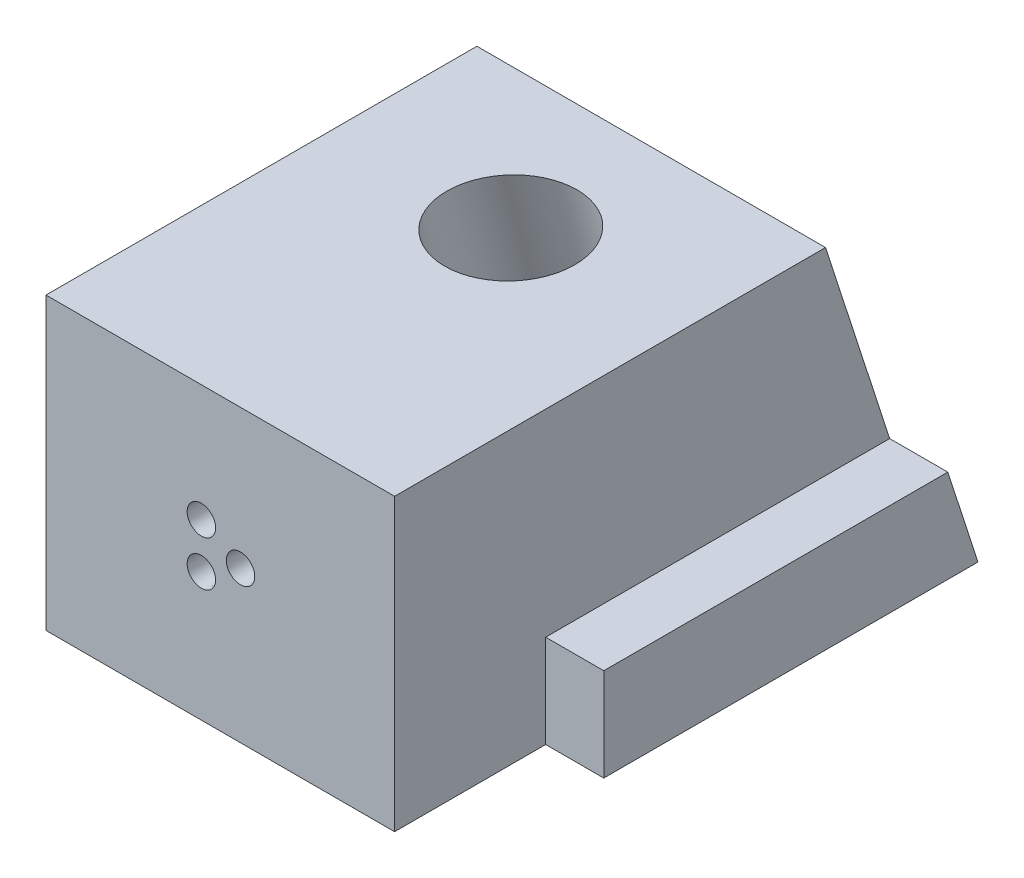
ISO-10303-21;
HEADER;
FILE_DESCRIPTION(('STEP AP214'),'2;1');
FILE_NAME('part.step','',(''),(''),'','','');
FILE_SCHEMA(('AUTOMOTIVE_DESIGN { 1 0 10303 214 1 1 1 1 }'));
ENDSEC;
DATA;
#1=APPLICATION_CONTEXT('core data for automotive mechanical design processes');
#2=APPLICATION_PROTOCOL_DEFINITION('international standard','automotive_design',2000,#1);
#3=PRODUCT_CONTEXT('',#1,'mechanical');
#4=PRODUCT('Part','Part','',(#3));
#5=PRODUCT_RELATED_PRODUCT_CATEGORY('part','',(#4));
#6=PRODUCT_DEFINITION_FORMATION('','',#4);
#7=PRODUCT_DEFINITION_CONTEXT('part definition',#1,'design');
#8=PRODUCT_DEFINITION('design','',#6,#7);
#9=PRODUCT_DEFINITION_SHAPE('','',#8);
#10=(LENGTH_UNIT() NAMED_UNIT(*) SI_UNIT(.MILLI.,.METRE.));
#11=(NAMED_UNIT(*) PLANE_ANGLE_UNIT() SI_UNIT($,.RADIAN.));
#12=(NAMED_UNIT(*) SI_UNIT($,.STERADIAN.) SOLID_ANGLE_UNIT());
#13=UNCERTAINTY_MEASURE_WITH_UNIT(LENGTH_MEASURE(1.E-05),#10,'distance_accuracy_value','');
#14=(GEOMETRIC_REPRESENTATION_CONTEXT(3) GLOBAL_UNCERTAINTY_ASSIGNED_CONTEXT((#13)) GLOBAL_UNIT_ASSIGNED_CONTEXT((#10,
#11,#12)) REPRESENTATION_CONTEXT('',''));
#15=CARTESIAN_POINT('',(0.,0.,0.));
#16=DIRECTION('',(0.,0.,1.));
#17=DIRECTION('',(1.,0.,0.));
#18=AXIS2_PLACEMENT_3D('',#15,#16,#17);
#19=CARTESIAN_POINT('',(-10.,-5.00000000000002,-108.665097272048));
#20=DIRECTION('',(1.,0.,0.));
#21=DIRECTION('',(0.,1.,0.));
#22=AXIS2_PLACEMENT_3D('',#19,#20,#21);
#23=PLANE('',#22);
#24=DIRECTION('',(0.,0.,1.));
#25=VECTOR('',#24,1.);
#26=CARTESIAN_POINT('',(-10.,-5.00000000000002,-108.665097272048));
#27=LINE('',#26,#25);
#28=CARTESIAN_POINT('',(-10.,-5.,-65.5236348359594));
#29=VERTEX_POINT('',#28);
#30=CARTESIAN_POINT('',(-10.,-5.,-35.9174140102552));
#31=VERTEX_POINT('',#30);
#32=EDGE_CURVE('E163',#29,#31,#27,.T.);
#33=ORIENTED_EDGE('',*,*,#32,.T.);
#34=DIRECTION('',(0.,1.,0.));
#35=VECTOR('',#34,1.);
#36=CARTESIAN_POINT('',(-9.99999999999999,-13.,-35.9174140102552));
#37=LINE('',#36,#35);
#38=CARTESIAN_POINT('',(-9.99999999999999,-13.,-35.9174140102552));
#39=VERTEX_POINT('',#38);
#40=EDGE_CURVE('E131',#39,#31,#37,.T.);
#41=ORIENTED_EDGE('',*,*,#40,.F.);
#42=DIRECTION('',(0.,0.,1.));
#43=VECTOR('',#42,1.);
#44=CARTESIAN_POINT('',(-10.,-13.,-108.665097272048));
#45=LINE('',#44,#43);
#46=CARTESIAN_POINT('',(-9.99999999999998,-13.,-68.1229924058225));
#47=VERTEX_POINT('',#46);
#48=EDGE_CURVE('E164',#47,#39,#45,.T.);
#49=ORIENTED_EDGE('',*,*,#48,.F.);
#50=DIRECTION('',(0.,0.951056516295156,0.309016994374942));
#51=VECTOR('',#50,1.);
#52=CARTESIAN_POINT('',(-9.99999999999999,-17.6789576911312,-69.6432779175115));
#53=LINE('',#52,#51);
#54=EDGE_CURVE('E160',#47,#29,#53,.T.);
#55=ORIENTED_EDGE('',*,*,#54,.T.);
#56=EDGE_LOOP('',(#33,#41,#49,#55));
#57=FACE_BOUND('',#56,.T.);
#58=ADVANCED_FACE('F37',(#57),#23,.T.);
#59=CARTESIAN_POINT('',(-10.,-5.00000000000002,-108.665097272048));
#60=DIRECTION('',(0.,1.,0.));
#61=DIRECTION('',(-1.,0.,0.));
#62=AXIS2_PLACEMENT_3D('',#59,#60,#61);
#63=PLANE('',#62);
#64=DIRECTION('',(0.,0.,1.));
#65=VECTOR('',#64,1.);
#66=CARTESIAN_POINT('',(-15.,-5.,-35.));
#67=LINE('',#66,#65);
#68=CARTESIAN_POINT('',(-15.,-5.00000000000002,-65.5236348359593));
#69=VERTEX_POINT('',#68);
#70=CARTESIAN_POINT('',(-15.,-5.,-35.9174140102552));
#71=VERTEX_POINT('',#70);
#72=EDGE_CURVE('E179',#69,#71,#67,.T.);
#73=ORIENTED_EDGE('',*,*,#72,.T.);
#74=DIRECTION('',(-1.,0.,0.));
#75=VECTOR('',#74,1.);
#76=CARTESIAN_POINT('',(-10.,-5.,-35.9174140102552));
#77=LINE('',#76,#75);
#78=EDGE_CURVE('E133',#31,#71,#77,.T.);
#79=ORIENTED_EDGE('',*,*,#78,.F.);
#80=ORIENTED_EDGE('',*,*,#32,.F.);
#81=DIRECTION('',(-1.,0.,0.));
#82=VECTOR('',#81,1.);
#83=CARTESIAN_POINT('',(-10.,-5.,-65.5236348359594));
#84=LINE('',#83,#82);
#85=EDGE_CURVE('E156',#29,#69,#84,.T.);
#86=ORIENTED_EDGE('',*,*,#85,.T.);
#87=EDGE_LOOP('',(#73,#79,#80,#86));
#88=FACE_BOUND('',#87,.T.);
#89=ADVANCED_FACE('F245',(#88),#63,.T.);
#90=CARTESIAN_POINT('',(-45.,-22.,-35.));
#91=DIRECTION('',(-1.,0.,0.));
#92=DIRECTION('',(0.,0.,1.));
#93=AXIS2_PLACEMENT_3D('',#90,#91,#92);
#94=PLANE('',#93);
#95=DIRECTION('',(0.,0.,-1.));
#96=VECTOR('',#95,1.);
#97=CARTESIAN_POINT('',(-45.,-5.,-35.));
#98=LINE('',#97,#96);
#99=CARTESIAN_POINT('',(-45.,-5.,-35.9174140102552));
#100=VERTEX_POINT('',#99);
#101=CARTESIAN_POINT('',(-45.,-5.00000000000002,-65.5236348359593));
#102=VERTEX_POINT('',#101);
#103=EDGE_CURVE('E182',#100,#102,#98,.T.);
#104=ORIENTED_EDGE('',*,*,#103,.F.);
#105=DIRECTION('',(0.,1.,0.));
#106=VECTOR('',#105,1.);
#107=CARTESIAN_POINT('',(-45.,-13.,-35.9174140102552));
#108=LINE('',#107,#106);
#109=CARTESIAN_POINT('',(-45.,-13.,-35.9174140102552));
#110=VERTEX_POINT('',#109);
#111=EDGE_CURVE('E146',#110,#100,#108,.T.);
#112=ORIENTED_EDGE('',*,*,#111,.F.);
#113=DIRECTION('',(0.,0.,1.));
#114=VECTOR('',#113,1.);
#115=CARTESIAN_POINT('',(-45.,-13.,-35.9174140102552));
#116=LINE('',#115,#114);
#117=CARTESIAN_POINT('',(-45.,-13.,-22.9174140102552));
#118=VERTEX_POINT('',#117);
#119=EDGE_CURVE('E149',#110,#118,#116,.T.);
#120=ORIENTED_EDGE('',*,*,#119,.T.);
#121=DIRECTION('',(0.,1.,0.));
#122=VECTOR('',#121,1.);
#123=CARTESIAN_POINT('',(-45.,-22.,-22.9174140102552));
#124=LINE('',#123,#122);
#125=CARTESIAN_POINT('',(-45.,12.,-22.9174140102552));
#126=VERTEX_POINT('',#125);
#127=EDGE_CURVE('E200',#118,#126,#124,.T.);
#128=ORIENTED_EDGE('',*,*,#127,.T.);
#129=DIRECTION('',(0.,0.,1.));
#130=VECTOR('',#129,1.);
#131=CARTESIAN_POINT('',(-45.,12.,-35.));
#132=LINE('',#131,#130);
#133=CARTESIAN_POINT('',(-45.,12.,-60.));
#134=VERTEX_POINT('',#133);
#135=EDGE_CURVE('E191',#134,#126,#132,.T.);
#136=ORIENTED_EDGE('',*,*,#135,.F.);
#137=DIRECTION('',(0.,0.951056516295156,0.309016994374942));
#138=VECTOR('',#137,1.);
#139=CARTESIAN_POINT('',(-45.,12.,-60.));
#140=LINE('',#139,#138);
#141=EDGE_CURVE('E186',#102,#134,#140,.T.);
#142=ORIENTED_EDGE('',*,*,#141,.F.);
#143=EDGE_LOOP('',(#104,#112,#120,#128,#136,#142));
#144=FACE_BOUND('',#143,.T.);
#145=ADVANCED_FACE('F251',(#144),#94,.T.);
#146=CARTESIAN_POINT('',(-15.,-22.,-35.));
#147=DIRECTION('',(1.,0.,0.));
#148=DIRECTION('',(0.,0.,-1.));
#149=AXIS2_PLACEMENT_3D('',#146,#147,#148);
#150=PLANE('',#149);
#151=ORIENTED_EDGE('',*,*,#72,.F.);
#152=DIRECTION('',(0.,0.951056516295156,0.309016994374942));
#153=VECTOR('',#152,1.);
#154=CARTESIAN_POINT('',(-15.,12.,-60.));
#155=LINE('',#154,#153);
#156=CARTESIAN_POINT('',(-15.,12.,-60.));
#157=VERTEX_POINT('',#156);
#158=EDGE_CURVE('E184',#69,#157,#155,.T.);
#159=ORIENTED_EDGE('',*,*,#158,.T.);
#160=DIRECTION('',(0.,0.,-1.));
#161=VECTOR('',#160,1.);
#162=CARTESIAN_POINT('',(-15.,12.,-22.9174140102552));
#163=LINE('',#162,#161);
#164=CARTESIAN_POINT('',(-15.,12.,-22.9174140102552));
#165=VERTEX_POINT('',#164);
#166=EDGE_CURVE('E197',#165,#157,#163,.T.);
#167=ORIENTED_EDGE('',*,*,#166,.F.);
#168=DIRECTION('',(0.,1.,0.));
#169=VECTOR('',#168,1.);
#170=CARTESIAN_POINT('',(-15.,-22.,-22.9174140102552));
#171=LINE('',#170,#169);
#172=CARTESIAN_POINT('',(-15.,-13.,-22.9174140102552));
#173=VERTEX_POINT('',#172);
#174=EDGE_CURVE('E201',#173,#165,#171,.T.);
#175=ORIENTED_EDGE('',*,*,#174,.F.);
#176=DIRECTION('',(0.,0.,1.));
#177=VECTOR('',#176,1.);
#178=CARTESIAN_POINT('',(-15.,-13.,-35.9174140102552));
#179=LINE('',#178,#177);
#180=CARTESIAN_POINT('',(-15.,-13.,-35.9174140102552));
#181=VERTEX_POINT('',#180);
#182=EDGE_CURVE('E138',#181,#173,#179,.T.);
#183=ORIENTED_EDGE('',*,*,#182,.F.);
#184=DIRECTION('',(0.,-1.,0.));
#185=VECTOR('',#184,1.);
#186=CARTESIAN_POINT('',(-15.,-13.,-35.9174140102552));
#187=LINE('',#186,#185);
#188=EDGE_CURVE('E53',#71,#181,#187,.T.);
#189=ORIENTED_EDGE('',*,*,#188,.F.);
#190=EDGE_LOOP('',(#151,#159,#167,#175,#183,#189));
#191=FACE_BOUND('',#190,.T.);
#192=ADVANCED_FACE('F274',(#191),#150,.T.);
#193=CARTESIAN_POINT('',(-30.5060153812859,0.000361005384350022,-22.9174140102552));
#194=DIRECTION('',(0.,0.,-1.));
#195=DIRECTION('',(0.,-1.,0.));
#196=AXIS2_PLACEMENT_3D('',#193,#194,#195);
#197=PLANE('',#196);
#198=DIRECTION('',(1.,0.,0.));
#199=VECTOR('',#198,1.);
#200=CARTESIAN_POINT('',(-10.,-13.,-22.9174140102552));
#201=LINE('',#200,#199);
#202=EDGE_CURVE('E152',#118,#173,#201,.T.);
#203=ORIENTED_EDGE('',*,*,#202,.T.);
#204=ORIENTED_EDGE('',*,*,#174,.T.);
#205=DIRECTION('',(1.,0.,0.));
#206=VECTOR('',#205,1.);
#207=CARTESIAN_POINT('',(-45.,12.,-22.9174140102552));
#208=LINE('',#207,#206);
#209=EDGE_CURVE('E194',#126,#165,#208,.T.);
#210=ORIENTED_EDGE('',*,*,#209,.F.);
#211=ORIENTED_EDGE('',*,*,#127,.F.);
#212=EDGE_LOOP('',(#203,#204,#210,#211));
#213=FACE_BOUND('',#212,.T.);
#214=CARTESIAN_POINT('',(-31.6280153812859,1.94372201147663,-22.9174140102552));
#215=DIRECTION('',(0.,0.,-1.));
#216=DIRECTION('',(0.866025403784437,0.500000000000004,0.));
#217=AXIS2_PLACEMENT_3D('',#214,#215,#216);
#218=CIRCLE('',#217,1.224);
#219=CARTESIAN_POINT('',(-30.5680002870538,2.55572201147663,-22.9174140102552));
#220=VERTEX_POINT('',#219);
#221=EDGE_CURVE('E207',#220,#220,#218,.T.);
#222=ORIENTED_EDGE('',*,*,#221,.T.);
#223=EDGE_LOOP('',(#222));
#224=FACE_BOUND('',#223,.T.);
#225=CARTESIAN_POINT('',(-28.2620153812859,0.000361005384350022,-22.9174140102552));
#226=DIRECTION('',(0.,0.,-1.));
#227=DIRECTION('',(0.,-1.,0.));
#228=AXIS2_PLACEMENT_3D('',#225,#226,#227);
#229=CIRCLE('',#228,1.224);
#230=CARTESIAN_POINT('',(-28.2620153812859,-1.22363899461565,-22.9174140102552));
#231=VERTEX_POINT('',#230);
#232=EDGE_CURVE('E210',#231,#231,#229,.T.);
#233=ORIENTED_EDGE('',*,*,#232,.T.);
#234=EDGE_LOOP('',(#233));
#235=FACE_BOUND('',#234,.T.);
#236=CARTESIAN_POINT('',(-31.6280153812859,-1.94300000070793,-22.9174140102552));
#237=DIRECTION('',(0.,0.,-1.));
#238=DIRECTION('',(-0.866025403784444,0.499999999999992,0.));
#239=AXIS2_PLACEMENT_3D('',#236,#237,#238);
#240=CIRCLE('',#239,1.224);
#241=CARTESIAN_POINT('',(-32.6880304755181,-1.33100000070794,-22.9174140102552));
#242=VERTEX_POINT('',#241);
#243=EDGE_CURVE('E203',#242,#242,#240,.T.);
#244=ORIENTED_EDGE('',*,*,#243,.T.);
#245=EDGE_LOOP('',(#244));
#246=FACE_BOUND('',#245,.T.);
#247=ADVANCED_FACE('F39',(#213,#224,#235,#246),#197,.F.);
#248=CARTESIAN_POINT('',(-28.2620153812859,0.000361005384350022,-22.9174140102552));
#249=DIRECTION('',(0.,0.,1.));
#250=DIRECTION('',(0.,-1.,0.));
#251=AXIS2_PLACEMENT_3D('',#248,#249,#250);
#252=CONICAL_SURFACE('',#251,1.224,0.0174532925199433);
#253=CARTESIAN_POINT('',(-28.2620153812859,0.000361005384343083,-26.4963147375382));
#254=DIRECTION('',(0.,0.,1.));
#255=DIRECTION('',(0.,1.,0.));
#256=AXIS2_PLACEMENT_3D('',#253,#254,#255);
#257=CIRCLE('',#256,1.16153005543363);
#258=CARTESIAN_POINT('',(-28.2620153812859,1.16189106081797,-26.4963147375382));
#259=VERTEX_POINT('',#258);
#260=EDGE_CURVE('E216',#259,#259,#257,.T.);
#261=ORIENTED_EDGE('',*,*,#260,.F.);
#262=EDGE_LOOP('',(#261));
#263=FACE_BOUND('',#262,.T.);
#264=ORIENTED_EDGE('',*,*,#232,.F.);
#265=EDGE_LOOP('',(#264));
#266=FACE_BOUND('',#265,.T.);
#267=ADVANCED_FACE('F290',(#263,#266),#252,.F.);
#268=CARTESIAN_POINT('',(-28.2620153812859,0.000361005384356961,-26.9974140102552));
#269=DIRECTION('',(0.,0.,-1.));
#270=DIRECTION('',(0.,-1.,0.));
#271=AXIS2_PLACEMENT_3D('',#268,#269,#270);
#272=PLANE('',#271);
#273=CARTESIAN_POINT('',(-28.2620153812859,0.000361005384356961,-26.9974140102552));
#274=DIRECTION('',(0.,0.,-1.));
#275=DIRECTION('',(0.,-1.,0.));
#276=AXIS2_PLACEMENT_3D('',#273,#274,#275);
#277=CIRCLE('',#276,0.65160773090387);
#278=CARTESIAN_POINT('',(-28.2620153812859,-0.651246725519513,-26.9974140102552));
#279=VERTEX_POINT('',#278);
#280=EDGE_CURVE('E213',#279,#279,#277,.T.);
#281=ORIENTED_EDGE('',*,*,#280,.F.);
#282=EDGE_LOOP('',(#281));
#283=FACE_BOUND('',#282,.T.);
#284=ADVANCED_FACE('F295',(#283),#272,.F.);
#285=CARTESIAN_POINT('',(-28.2620153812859,0.000361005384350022,-26.4874140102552));
#286=DIRECTION('',(0.,0.,-1.));
#287=DIRECTION('',(0.,-1.,0.));
#288=AXIS2_PLACEMENT_3D('',#285,#286,#287);
#289=TOROIDAL_SURFACE('',#288,0.65160773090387,0.51);
#290=ORIENTED_EDGE('',*,*,#260,.T.);
#291=EDGE_LOOP('',(#290));
#292=FACE_BOUND('',#291,.T.);
#293=ORIENTED_EDGE('',*,*,#280,.T.);
#294=EDGE_LOOP('',(#293));
#295=FACE_BOUND('',#294,.T.);
#296=ADVANCED_FACE('F306',(#292,#295),#289,.F.);
#297=CARTESIAN_POINT('',(-31.6280153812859,1.94372201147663,-22.9174140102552));
#298=DIRECTION('',(0.,0.,1.));
#299=DIRECTION('',(0.866025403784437,0.500000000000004,0.));
#300=AXIS2_PLACEMENT_3D('',#297,#298,#299);
#301=CONICAL_SURFACE('',#300,1.224,0.0174532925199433);
#302=CARTESIAN_POINT('',(-31.6280153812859,1.94372201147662,-26.4963147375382));
#303=DIRECTION('',(0.,0.,1.));
#304=DIRECTION('',(0.,1.,0.));
#305=AXIS2_PLACEMENT_3D('',#302,#303,#304);
#306=CIRCLE('',#305,1.16153005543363);
#307=CARTESIAN_POINT('',(-31.6280153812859,3.10525206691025,-26.4963147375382));
#308=VERTEX_POINT('',#307);
#309=EDGE_CURVE('E222',#308,#308,#306,.T.);
#310=ORIENTED_EDGE('',*,*,#309,.F.);
#311=EDGE_LOOP('',(#310));
#312=FACE_BOUND('',#311,.T.);
#313=ORIENTED_EDGE('',*,*,#221,.F.);
#314=EDGE_LOOP('',(#313));
#315=FACE_BOUND('',#314,.T.);
#316=ADVANCED_FACE('F304',(#312,#315),#301,.F.);
#317=CARTESIAN_POINT('',(-31.6280153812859,1.94372201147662,-26.9974140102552));
#318=DIRECTION('',(0.,0.,-1.));
#319=DIRECTION('',(0.866025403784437,0.500000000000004,0.));
#320=AXIS2_PLACEMENT_3D('',#317,#318,#319);
#321=PLANE('',#320);
#322=CARTESIAN_POINT('',(-31.6280153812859,1.94372201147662,-26.9974140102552));
#323=DIRECTION('',(0.,0.,-1.));
#324=DIRECTION('',(0.,-1.,0.));
#325=AXIS2_PLACEMENT_3D('',#322,#323,#324);
#326=CIRCLE('',#325,0.65160773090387);
#327=CARTESIAN_POINT('',(-31.6280153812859,1.29211428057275,-26.9974140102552));
#328=VERTEX_POINT('',#327);
#329=EDGE_CURVE('E219',#328,#328,#326,.T.);
#330=ORIENTED_EDGE('',*,*,#329,.F.);
#331=EDGE_LOOP('',(#330));
#332=FACE_BOUND('',#331,.T.);
#333=ADVANCED_FACE('F241',(#332),#321,.F.);
#334=CARTESIAN_POINT('',(-31.6280153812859,-1.94300000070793,-22.9174140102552));
#335=DIRECTION('',(0.,0.,1.));
#336=DIRECTION('',(-0.866025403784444,0.499999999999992,0.));
#337=AXIS2_PLACEMENT_3D('',#334,#335,#336);
#338=CONICAL_SURFACE('',#337,1.224,0.0174532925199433);
#339=CARTESIAN_POINT('',(-31.6280153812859,-1.94300000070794,-26.4963147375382));
#340=DIRECTION('',(0.,0.,1.));
#341=DIRECTION('',(0.,1.,0.));
#342=AXIS2_PLACEMENT_3D('',#339,#340,#341);
#343=CIRCLE('',#342,1.16153005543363);
#344=CARTESIAN_POINT('',(-31.6280153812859,-0.781469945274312,-26.4963147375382));
#345=VERTEX_POINT('',#344);
#346=EDGE_CURVE('E12',#345,#345,#343,.T.);
#347=ORIENTED_EDGE('',*,*,#346,.F.);
#348=EDGE_LOOP('',(#347));
#349=FACE_BOUND('',#348,.T.);
#350=ORIENTED_EDGE('',*,*,#243,.F.);
#351=EDGE_LOOP('',(#350));
#352=FACE_BOUND('',#351,.T.);
#353=ADVANCED_FACE('F233',(#349,#352),#338,.F.);
#354=CARTESIAN_POINT('',(-31.6280153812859,-1.94300000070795,-26.9974140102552));
#355=DIRECTION('',(0.,0.,-1.));
#356=DIRECTION('',(-0.866025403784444,0.499999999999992,0.));
#357=AXIS2_PLACEMENT_3D('',#354,#355,#356);
#358=PLANE('',#357);
#359=CARTESIAN_POINT('',(-31.6280153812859,-1.94300000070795,-26.9974140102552));
#360=DIRECTION('',(0.,0.,-1.));
#361=DIRECTION('',(0.,-1.,0.));
#362=AXIS2_PLACEMENT_3D('',#359,#360,#361);
#363=CIRCLE('',#362,0.65160773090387);
#364=CARTESIAN_POINT('',(-31.6280153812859,-2.59460773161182,-26.9974140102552));
#365=VERTEX_POINT('',#364);
#366=EDGE_CURVE('E46',#365,#365,#363,.T.);
#367=ORIENTED_EDGE('',*,*,#366,.F.);
#368=EDGE_LOOP('',(#367));
#369=FACE_BOUND('',#368,.T.);
#370=ADVANCED_FACE('F230',(#369),#358,.F.);
#371=CARTESIAN_POINT('',(-31.6280153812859,1.94372201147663,-26.4874140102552));
#372=DIRECTION('',(0.,0.,-1.));
#373=DIRECTION('',(0.,-1.,0.));
#374=AXIS2_PLACEMENT_3D('',#371,#372,#373);
#375=TOROIDAL_SURFACE('',#374,0.65160773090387,0.51);
#376=ORIENTED_EDGE('',*,*,#309,.T.);
#377=EDGE_LOOP('',(#376));
#378=FACE_BOUND('',#377,.T.);
#379=ORIENTED_EDGE('',*,*,#329,.T.);
#380=EDGE_LOOP('',(#379));
#381=FACE_BOUND('',#380,.T.);
#382=ADVANCED_FACE('F232',(#378,#381),#375,.F.);
#383=CARTESIAN_POINT('',(-31.6280153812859,-1.94300000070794,-26.4874140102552));
#384=DIRECTION('',(0.,0.,-1.));
#385=DIRECTION('',(0.,-1.,0.));
#386=AXIS2_PLACEMENT_3D('',#383,#384,#385);
#387=TOROIDAL_SURFACE('',#386,0.65160773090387,0.51);
#388=ORIENTED_EDGE('',*,*,#346,.T.);
#389=EDGE_LOOP('',(#388));
#390=FACE_BOUND('',#389,.T.);
#391=ORIENTED_EDGE('',*,*,#366,.T.);
#392=EDGE_LOOP('',(#391));
#393=FACE_BOUND('',#392,.T.);
#394=ADVANCED_FACE('F228',(#390,#393),#387,.F.);
#395=CARTESIAN_POINT('',(-45.,12.,-35.));
#396=DIRECTION('',(0.,1.,0.));
#397=DIRECTION('',(0.,0.,1.));
#398=AXIS2_PLACEMENT_3D('',#395,#396,#397);
#399=PLANE('',#398);
#400=CARTESIAN_POINT('',(-30.,12.,-47.9174140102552));
#401=DIRECTION('',(0.,1.,0.));
#402=DIRECTION('',(0.,0.,1.));
#403=AXIS2_PLACEMENT_3D('',#400,#401,#402);
#404=ELLIPSE('',#403,5.69401899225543,5.5);
#405=CARTESIAN_POINT('',(-30.,12.,-42.2233950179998));
#406=VERTEX_POINT('',#405);
#407=EDGE_CURVE('E127',#406,#406,#404,.T.);
#408=ORIENTED_EDGE('',*,*,#407,.F.);
#409=EDGE_LOOP('',(#408));
#410=FACE_BOUND('',#409,.T.);
#411=ORIENTED_EDGE('',*,*,#166,.T.);
#412=DIRECTION('',(1.,0.,0.));
#413=VECTOR('',#412,1.);
#414=CARTESIAN_POINT('',(-45.,12.,-60.));
#415=LINE('',#414,#413);
#416=EDGE_CURVE('E188',#134,#157,#415,.T.);
#417=ORIENTED_EDGE('',*,*,#416,.F.);
#418=ORIENTED_EDGE('',*,*,#135,.T.);
#419=ORIENTED_EDGE('',*,*,#209,.T.);
#420=EDGE_LOOP('',(#411,#417,#418,#419));
#421=FACE_BOUND('',#420,.T.);
#422=ADVANCED_FACE('F269',(#410,#421),#399,.T.);
#423=CARTESIAN_POINT('',(-80.7497156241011,12.,-60.0000000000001));
#424=DIRECTION('',(0.,0.309016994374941,-0.951056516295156));
#425=DIRECTION('',(0.,0.951056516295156,0.309016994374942));
#426=AXIS2_PLACEMENT_3D('',#423,#424,#425);
#427=PLANE('',#426);
#428=ORIENTED_EDGE('',*,*,#54,.F.);
#429=DIRECTION('',(1.,0.,0.));
#430=VECTOR('',#429,1.);
#431=CARTESIAN_POINT('',(-10.,-13.,-68.1229924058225));
#432=LINE('',#431,#430);
#433=CARTESIAN_POINT('',(-50.0000000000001,-13.,-68.1229924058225));
#434=VERTEX_POINT('',#433);
#435=EDGE_CURVE('E165',#434,#47,#432,.T.);
#436=ORIENTED_EDGE('',*,*,#435,.F.);
#437=DIRECTION('',(0.,-0.951056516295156,-0.309016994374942));
#438=VECTOR('',#437,1.);
#439=CARTESIAN_POINT('',(-50.0000000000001,-17.6789576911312,-69.6432779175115));
#440=LINE('',#439,#438);
#441=CARTESIAN_POINT('',(-50.,-5.00000000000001,-65.5236348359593));
#442=VERTEX_POINT('',#441);
#443=EDGE_CURVE('E168',#442,#434,#440,.T.);
#444=ORIENTED_EDGE('',*,*,#443,.F.);
#445=EDGE_CURVE('E155',#102,#442,#84,.T.);
#446=ORIENTED_EDGE('',*,*,#445,.F.);
#447=ORIENTED_EDGE('',*,*,#141,.T.);
#448=ORIENTED_EDGE('',*,*,#416,.T.);
#449=ORIENTED_EDGE('',*,*,#158,.F.);
#450=ORIENTED_EDGE('',*,*,#85,.F.);
#451=EDGE_LOOP('',(#428,#436,#444,#446,#447,#448,#449,#450));
#452=FACE_BOUND('',#451,.T.);
#453=ADVANCED_FACE('F266',(#452),#427,.T.);
#454=DIRECTION('',(-1.,0.,0.));
#455=VECTOR('',#454,1.);
#456=CARTESIAN_POINT('',(-50.,-5.,-35.9174140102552));
#457=LINE('',#456,#455);
#458=CARTESIAN_POINT('',(-50.,-5.,-35.9174140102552));
#459=VERTEX_POINT('',#458);
#460=EDGE_CURVE('E61',#100,#459,#457,.T.);
#461=ORIENTED_EDGE('',*,*,#460,.F.);
#462=ORIENTED_EDGE('',*,*,#103,.T.);
#463=ORIENTED_EDGE('',*,*,#445,.T.);
#464=DIRECTION('',(0.,0.,1.));
#465=VECTOR('',#464,1.);
#466=CARTESIAN_POINT('',(-50.,-5.00000000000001,-108.665097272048));
#467=LINE('',#466,#465);
#468=EDGE_CURVE('E159',#442,#459,#467,.T.);
#469=ORIENTED_EDGE('',*,*,#468,.T.);
#470=EDGE_LOOP('',(#461,#462,#463,#469));
#471=FACE_BOUND('',#470,.T.);
#472=ADVANCED_FACE('F254',(#471),#63,.T.);
#473=CARTESIAN_POINT('',(-10.,-13.,-108.665097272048));
#474=DIRECTION('',(0.,-1.,0.));
#475=DIRECTION('',(1.,0.,0.));
#476=AXIS2_PLACEMENT_3D('',#473,#474,#475);
#477=PLANE('',#476);
#478=CARTESIAN_POINT('',(-30.,-13.,-32.7174140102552));
#479=DIRECTION('',(0.,-1.,0.));
#480=DIRECTION('',(1.,0.,0.));
#481=AXIS2_PLACEMENT_3D('',#478,#479,#480);
#482=CIRCLE('',#481,2.);
#483=CARTESIAN_POINT('',(-28.,-13.,-32.7174140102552));
#484=VERTEX_POINT('',#483);
#485=EDGE_CURVE('E123',#484,#484,#482,.T.);
#486=ORIENTED_EDGE('',*,*,#485,.F.);
#487=EDGE_LOOP('',(#486));
#488=FACE_BOUND('',#487,.T.);
#489=CARTESIAN_POINT('',(-30.,-13.,-54.6161438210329));
#490=DIRECTION('',(0.,-1.,0.));
#491=DIRECTION('',(0.,0.,1.));
#492=AXIS2_PLACEMENT_3D('',#489,#490,#491);
#493=ELLIPSE('',#492,5.69401899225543,5.5);
#494=CARTESIAN_POINT('',(-30.,-13.,-48.9221248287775));
#495=VERTEX_POINT('',#494);
#496=EDGE_CURVE('E41',#495,#495,#493,.T.);
#497=ORIENTED_EDGE('',*,*,#496,.F.);
#498=EDGE_LOOP('',(#497));
#499=FACE_BOUND('',#498,.T.);
#500=ORIENTED_EDGE('',*,*,#182,.T.);
#501=ORIENTED_EDGE('',*,*,#202,.F.);
#502=ORIENTED_EDGE('',*,*,#119,.F.);
#503=DIRECTION('',(1.,0.,0.));
#504=VECTOR('',#503,1.);
#505=CARTESIAN_POINT('',(-50.0000000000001,-13.,-35.9174140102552));
#506=LINE('',#505,#504);
#507=CARTESIAN_POINT('',(-50.0000000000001,-13.,-35.9174140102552));
#508=VERTEX_POINT('',#507);
#509=EDGE_CURVE('E143',#508,#110,#506,.T.);
#510=ORIENTED_EDGE('',*,*,#509,.F.);
#511=DIRECTION('',(0.,0.,1.));
#512=VECTOR('',#511,1.);
#513=CARTESIAN_POINT('',(-50.,-13.,-108.665097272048));
#514=LINE('',#513,#512);
#515=EDGE_CURVE('E167',#434,#508,#514,.T.);
#516=ORIENTED_EDGE('',*,*,#515,.F.);
#517=ORIENTED_EDGE('',*,*,#435,.T.);
#518=ORIENTED_EDGE('',*,*,#48,.T.);
#519=DIRECTION('',(1.,0.,0.));
#520=VECTOR('',#519,1.);
#521=CARTESIAN_POINT('',(-9.99999999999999,-13.,-35.9174140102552));
#522=LINE('',#521,#520);
#523=EDGE_CURVE('E136',#181,#39,#522,.T.);
#524=ORIENTED_EDGE('',*,*,#523,.F.);
#525=EDGE_LOOP('',(#500,#501,#502,#510,#516,#517,#518,#524));
#526=FACE_BOUND('',#525,.T.);
#527=ADVANCED_FACE('F259',(#488,#499,#526),#477,.T.);
#528=CARTESIAN_POINT('',(-50.,-5.00000000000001,-108.665097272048));
#529=DIRECTION('',(-1.,0.,0.));
#530=DIRECTION('',(0.,0.,1.));
#531=AXIS2_PLACEMENT_3D('',#528,#529,#530);
#532=PLANE('',#531);
#533=DIRECTION('',(0.,-1.,0.));
#534=VECTOR('',#533,1.);
#535=CARTESIAN_POINT('',(-50.0000000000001,-13.,-35.9174140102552));
#536=LINE('',#535,#534);
#537=EDGE_CURVE('E141',#459,#508,#536,.T.);
#538=ORIENTED_EDGE('',*,*,#537,.F.);
#539=ORIENTED_EDGE('',*,*,#468,.F.);
#540=ORIENTED_EDGE('',*,*,#443,.T.);
#541=ORIENTED_EDGE('',*,*,#515,.T.);
#542=EDGE_LOOP('',(#538,#539,#540,#541));
#543=FACE_BOUND('',#542,.T.);
#544=ADVANCED_FACE('F262',(#543),#532,.T.);
#545=CARTESIAN_POINT('',(-50.,-5.,-35.9174140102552));
#546=DIRECTION('',(0.,0.,-1.));
#547=DIRECTION('',(-1.,0.,0.));
#548=AXIS2_PLACEMENT_3D('',#545,#546,#547);
#549=PLANE('',#548);
#550=ORIENTED_EDGE('',*,*,#537,.T.);
#551=ORIENTED_EDGE('',*,*,#509,.T.);
#552=ORIENTED_EDGE('',*,*,#111,.T.);
#553=ORIENTED_EDGE('',*,*,#460,.T.);
#554=EDGE_LOOP('',(#550,#551,#552,#553));
#555=FACE_BOUND('',#554,.T.);
#556=ADVANCED_FACE('F257',(#555),#549,.F.);
#557=CARTESIAN_POINT('',(-10.,-5.,-35.9174140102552));
#558=DIRECTION('',(0.,0.,1.));
#559=DIRECTION('',(1.,0.,0.));
#560=AXIS2_PLACEMENT_3D('',#557,#558,#559);
#561=PLANE('',#560);
#562=ORIENTED_EDGE('',*,*,#40,.T.);
#563=ORIENTED_EDGE('',*,*,#78,.T.);
#564=ORIENTED_EDGE('',*,*,#188,.T.);
#565=ORIENTED_EDGE('',*,*,#523,.T.);
#566=EDGE_LOOP('',(#562,#563,#564,#565));
#567=FACE_BOUND('',#566,.T.);
#568=ADVANCED_FACE('F389',(#567),#561,.T.);
#569=CARTESIAN_POINT('',(-30.,-16.3767121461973,-55.5209311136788));
#570=DIRECTION('',(0.,0.965925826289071,0.258819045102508));
#571=DIRECTION('',(0.,-0.258819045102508,0.965925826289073));
#572=AXIS2_PLACEMENT_3D('',#569,#570,#571);
#573=CYLINDRICAL_SURFACE('',#572,5.5);
#574=ORIENTED_EDGE('',*,*,#407,.T.);
#575=EDGE_LOOP('',(#574));
#576=FACE_BOUND('',#575,.T.);
#577=ORIENTED_EDGE('',*,*,#496,.T.);
#578=EDGE_LOOP('',(#577));
#579=FACE_BOUND('',#578,.T.);
#580=ADVANCED_FACE('F119',(#576,#579),#573,.F.);
#581=CARTESIAN_POINT('',(-30.,-13.,-32.7174140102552));
#582=DIRECTION('',(0.,-1.,0.));
#583=DIRECTION('',(1.,0.,0.));
#584=AXIS2_PLACEMENT_3D('',#581,#582,#583);
#585=CONICAL_SURFACE('',#584,2.,1.0471975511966);
#586=CARTESIAN_POINT('',(-30.,-11.8452994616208,-32.7174140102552));
#587=VERTEX_POINT('',#586);
#588=VERTEX_LOOP('',#587);
#589=FACE_BOUND('',#588,.T.);
#590=ORIENTED_EDGE('',*,*,#485,.T.);
#591=EDGE_LOOP('',(#590));
#592=FACE_BOUND('',#591,.T.);
#593=ADVANCED_FACE('F116',(#589,#592),#585,.F.);
#594=CLOSED_SHELL('',(#58,#89,#145,#192,#247,#267,#284,#296,#316,#333,#353,#370,#382,#394,#422,
#453,#472,#527,#544,#556,#568,#580,#593));
#595=MANIFOLD_SOLID_BREP('B2',#594);
#596=ADVANCED_BREP_SHAPE_REPRESENTATION('',(#18,#595),#14);
#597=SHAPE_DEFINITION_REPRESENTATION(#9,#596);
ENDSEC;
END-ISO-10303-21;
